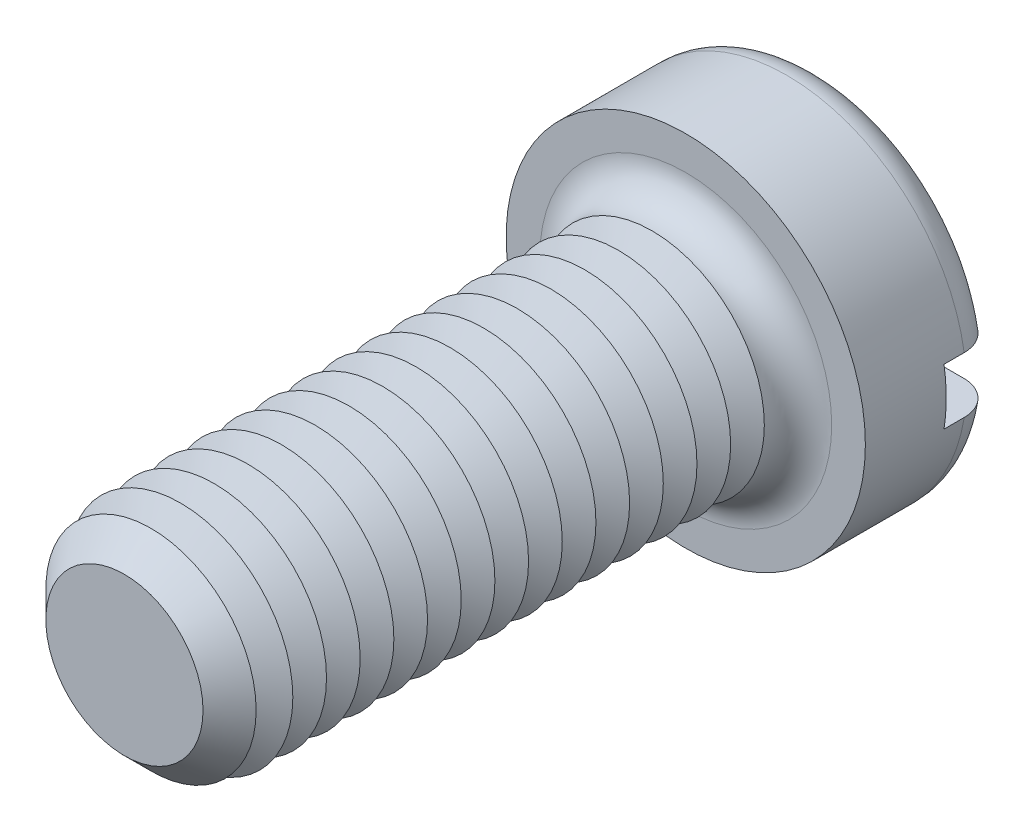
from build123d import *

# Parameters (mm, degrees)
SKETCH3_R           = 8
BOSS_EXTRUDE2_DEPTH = 6
SKETCH4_R           = 5
BOSS_EXTRUDE3_DEPTH = 25
FILLET1_R           = 1.5
CHAMFER1_SIZE       = 1.5
LPATTERN1_COUNT     = 15
LPATTERN1_PITCH     = 1.5
SKETCH8_W           = 16
SKETCH8_H           = 2.5
CUT_EXTRUDE1_DEPTH  = 2.4


with BuildPart() as part:
    # Sketch3 → Boss-Extrude2 (new body)
    with BuildSketch(Plane.XY):
        Circle(SKETCH3_R)
    extrude(amount=-BOSS_EXTRUDE2_DEPTH)

    # Sketch4 → Boss-Extrude3 (add)
    with BuildSketch(Plane.XY):
        Circle(SKETCH4_R)
    extrude(amount=BOSS_EXTRUDE3_DEPTH)

    # Fillet1
    fillet1_edges = [part.edges().sort_by_distance(p)[0] for p in [
        (-8, 0, -6),
        (-5, 0, 0),
    ]]
    fillet(fillet1_edges, radius=FILLET1_R)

    # Chamfer1
    chamfer1_edges = [part.edges().sort_by_distance(p)[0] for p in [
        (-5, 0, 25),
    ]]
    chamfer(chamfer1_edges, length=CHAMFER1_SIZE)

    # Sketch6 → Cut-Revolve1 (revolve, cut)
    with BuildSketch(Plane(origin=(0, 0, 0), x_dir=(0, 0, -1), z_dir=(1, 0, 0)), mode=Mode.PRIVATE) as cut_revolve1_sk:
        Polygon((-1.5, 5), (-2.25, 3.700961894), (-3, 5), align=None)
    cut_revolve1 = revolve(cut_revolve1_sk.sketch.rotate(Axis((0, 0, -1.694361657), (0, 0, 1)), 90), axis=Axis((0, 0, -1.694361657), (0, 0, 1)), mode=Mode.SUBTRACT)

    # LPattern1: Cut-Revolve1 ×15
    with Locations(*[(0, 0, i * LPATTERN1_PITCH) for i in range(1, LPATTERN1_COUNT)]):
        add(cut_revolve1, mode=Mode.SUBTRACT)

    # Sketch8 → Cut-Extrude1 (cut)
    with BuildSketch(Plane(origin=(0, 0, -6), x_dir=(-1, 0, 0), z_dir=(0, 0, -1))):
        Rectangle(SKETCH8_W, SKETCH8_H)
    extrude(amount=-CUT_EXTRUDE1_DEPTH, mode=Mode.SUBTRACT)


solid = part.part
